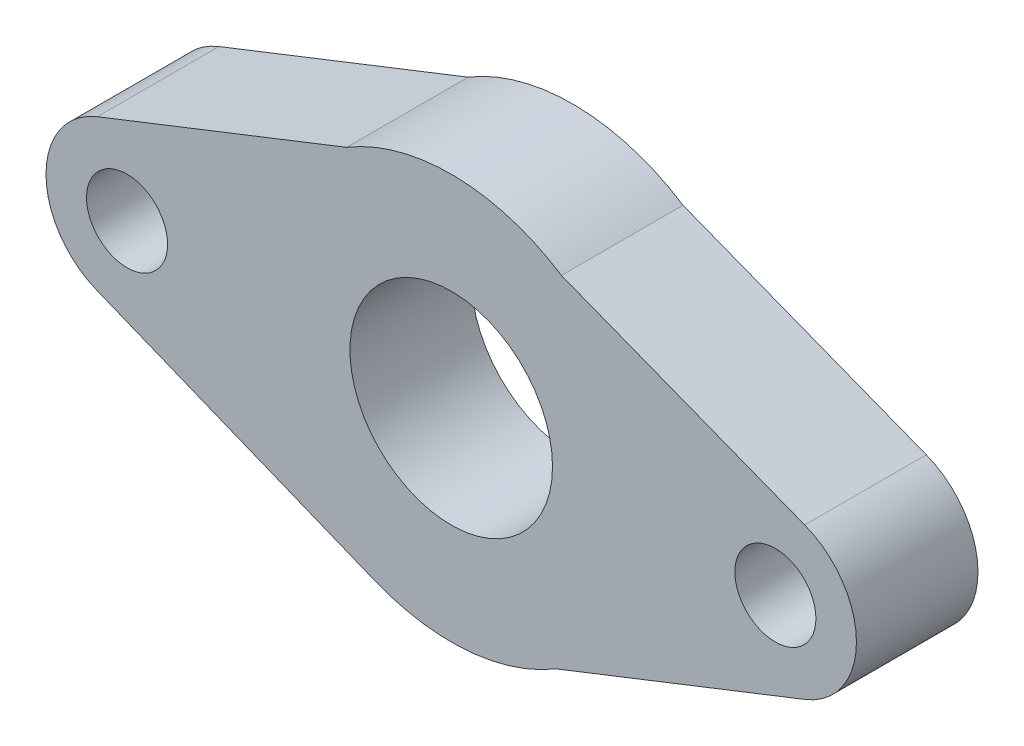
from build123d import *

# Parameters (mm, degrees)
ESBO_O1_R                = 5
ESBO_O1_R_2              = 12.5
RESSALTO_EXTRUS_O1_DEPTH = 15


with BuildPart() as part:
    # Esbo_o1 → Ressalto-extrus_o1 (new body)
    with BuildSketch(Plane.XY):
        with BuildLine():
            Line((-43.662314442, 9.30523793), (-12.910427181, 21.408429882))
            ThreePointArc((-12.910427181, 21.408429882), (0.409231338, 24.99665037), (13.604294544, 20.974345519))
            Line((13.604294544, 20.974345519), (43.61900985, 9.322165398))
            ThreePointArc((43.61900985, 9.322165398), (49.999972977, 0.023247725), (43.662314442, -9.30523793))
            Line((43.662314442, -9.30523793), (12.910427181, -21.408429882))
            ThreePointArc((12.910427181, -21.408429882), (1.892130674, -24.928293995), (-9.531209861, -23.111815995))
            Line((-9.531209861, -23.111815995), (-43.749856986, -9.27030596))
            ThreePointArc((-43.749856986, -9.27030596), (-49.99988895, 0.047127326), (-43.662314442, 9.30523793))
        make_face()
        with Locations((-40, 0)):
            Circle(ESBO_O1_R, mode=Mode.SUBTRACT)
        Circle(ESBO_O1_R_2, mode=Mode.SUBTRACT)
        with Locations((40, 0)):
            Circle(ESBO_O1_R, mode=Mode.SUBTRACT)
    extrude(amount=RESSALTO_EXTRUS_O1_DEPTH)


solid = part.part
